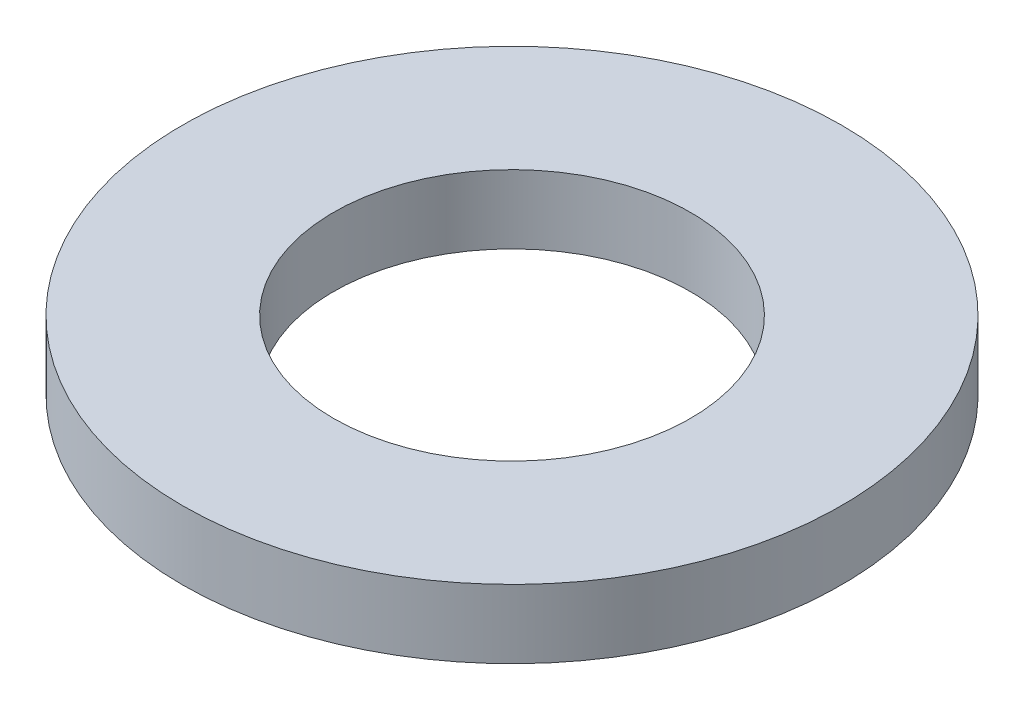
from build123d import *

# Parameters (mm, degrees)
SKETCH1_R      = 12
SKETCH1_R_2    = 6.5
EXTRUDE1_DEPTH = 2.5


with BuildPart() as part:
    # Sketch1 → Extrude1 (new body)
    with BuildSketch(Plane(origin=(0, 0, 0), x_dir=(1, 0, 0), z_dir=(0, 1, 0))):
        with Locations(Location((0, 0, 0), (0, 0, 270))):
            Circle(SKETCH1_R)
        with Locations(Location((0, 0, 0), (0, 0, 270))):
            Circle(SKETCH1_R_2, mode=Mode.SUBTRACT)
    extrude(amount=EXTRUDE1_DEPTH)


solid = part.part
